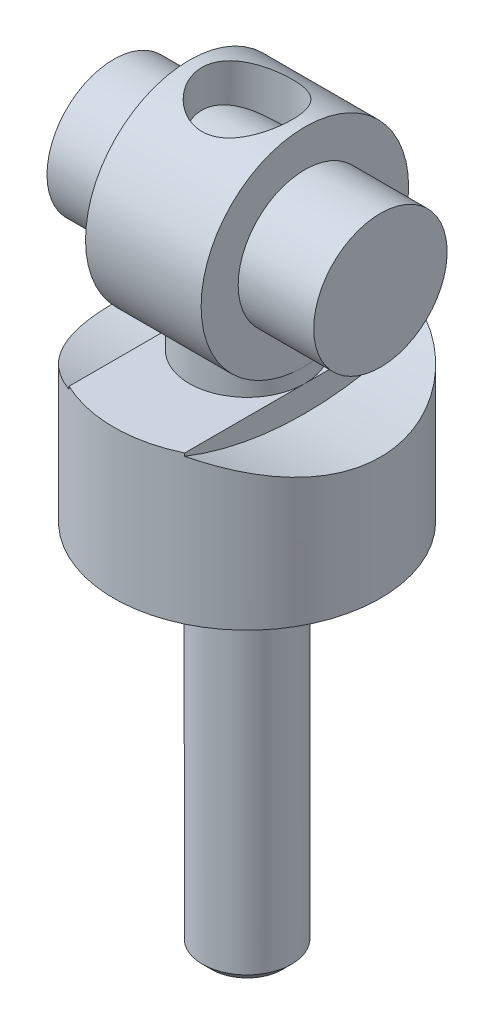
ISO-10303-21;
HEADER;
FILE_DESCRIPTION(('STEP AP214'),'2;1');
FILE_NAME('part.step','',(''),(''),'','','');
FILE_SCHEMA(('AUTOMOTIVE_DESIGN { 1 0 10303 214 1 1 1 1 }'));
ENDSEC;
DATA;
#1=APPLICATION_CONTEXT('core data for automotive mechanical design processes');
#2=APPLICATION_PROTOCOL_DEFINITION('international standard','automotive_design',2000,#1);
#3=PRODUCT_CONTEXT('',#1,'mechanical');
#4=PRODUCT('Part','Part','',(#3));
#5=PRODUCT_RELATED_PRODUCT_CATEGORY('part','',(#4));
#6=PRODUCT_DEFINITION_FORMATION('','',#4);
#7=PRODUCT_DEFINITION_CONTEXT('part definition',#1,'design');
#8=PRODUCT_DEFINITION('design','',#6,#7);
#9=PRODUCT_DEFINITION_SHAPE('','',#8);
#10=(LENGTH_UNIT() NAMED_UNIT(*) SI_UNIT(.MILLI.,.METRE.));
#11=(NAMED_UNIT(*) PLANE_ANGLE_UNIT() SI_UNIT($,.RADIAN.));
#12=(NAMED_UNIT(*) SI_UNIT($,.STERADIAN.) SOLID_ANGLE_UNIT());
#13=UNCERTAINTY_MEASURE_WITH_UNIT(LENGTH_MEASURE(1.E-05),#10,'distance_accuracy_value','');
#14=(GEOMETRIC_REPRESENTATION_CONTEXT(3) GLOBAL_UNCERTAINTY_ASSIGNED_CONTEXT((#13)) GLOBAL_UNIT_ASSIGNED_CONTEXT((#10,
#11,#12)) REPRESENTATION_CONTEXT('',''));
#15=CARTESIAN_POINT('',(0.,0.,0.));
#16=DIRECTION('',(0.,0.,1.));
#17=DIRECTION('',(1.,0.,0.));
#18=AXIS2_PLACEMENT_3D('',#15,#16,#17);
#19=CARTESIAN_POINT('',(9.,0.,0.));
#20=DIRECTION('',(-1.,0.,0.));
#21=DIRECTION('',(0.,0.,1.));
#22=AXIS2_PLACEMENT_3D('',#19,#20,#21);
#23=CYLINDRICAL_SURFACE('',#22,4.5);
#24=CARTESIAN_POINT('',(0.,3.30870065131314,-3.05));
#25=CARTESIAN_POINT('',(-0.0740543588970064,3.30870135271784,-3.04999955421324));
#26=CARTESIAN_POINT('',(-0.148113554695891,3.31120079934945,-3.04729547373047));
#27=CARTESIAN_POINT('',(-0.295501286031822,3.32105327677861,-3.03655247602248));
#28=CARTESIAN_POINT('',(-0.368829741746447,3.32840683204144,-3.02851298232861));
#29=CARTESIAN_POINT('',(-0.58695059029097,3.35728100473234,-2.99658701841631));
#30=CARTESIAN_POINT('',(-0.729787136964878,3.385614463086,-2.96489335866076));
#31=CARTESIAN_POINT('',(-1.00481607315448,3.45535402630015,-2.88328172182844));
#32=CARTESIAN_POINT('',(-1.13710040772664,3.49662694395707,-2.83354864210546));
#33=CARTESIAN_POINT('',(-1.39123632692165,3.58733287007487,-2.71780374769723));
#34=CARTESIAN_POINT('',(-1.51308617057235,3.63676723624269,-2.65178922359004));
#35=CARTESIAN_POINT('',(-1.76446479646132,3.74781440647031,-2.49293203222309));
#36=CARTESIAN_POINT('',(-1.8920441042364,3.81010328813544,-2.39747643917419));
#37=CARTESIAN_POINT('',(-2.13108358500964,3.93428541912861,-2.18776550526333));
#38=CARTESIAN_POINT('',(-2.2425254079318,3.99617814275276,-2.0734890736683));
#39=CARTESIAN_POINT('',(-2.46301512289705,4.1236708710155,-1.80832137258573));
#40=CARTESIAN_POINT('',(-2.56913328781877,4.1884081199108,-1.65450535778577));
#41=CARTESIAN_POINT('',(-2.70696690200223,4.2748001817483,-1.40843177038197));
#42=CARTESIAN_POINT('',(-2.74934801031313,4.30180769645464,-1.32386688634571));
#43=CARTESIAN_POINT('',(-2.82644155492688,4.35148238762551,-1.15011183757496));
#44=CARTESIAN_POINT('',(-2.86115705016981,4.37415129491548,-1.06092353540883));
#45=CARTESIAN_POINT('',(-2.93723315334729,4.42421178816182,-0.834029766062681));
#46=CARTESIAN_POINT('',(-2.97356864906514,4.44850916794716,-0.693888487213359));
#47=CARTESIAN_POINT('',(-3.02602447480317,4.48374237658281,-0.40832853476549));
#48=CARTESIAN_POINT('',(-3.04216027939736,4.49468843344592,-0.262913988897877));
#49=CARTESIAN_POINT('',(-3.0533671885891,4.5022807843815,0.0293654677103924));
#50=CARTESIAN_POINT('',(-3.04840293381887,4.49890307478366,0.176232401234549));
#51=CARTESIAN_POINT('',(-3.01761506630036,4.47809945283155,0.466749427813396));
#52=CARTESIAN_POINT('',(-2.99178532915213,4.46066941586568,0.610398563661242));
#53=CARTESIAN_POINT('',(-2.92131598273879,4.41371882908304,0.888013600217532));
#54=CARTESIAN_POINT('',(-2.87702540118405,4.384422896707,1.02210773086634));
#55=CARTESIAN_POINT('',(-2.77159197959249,4.31597239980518,1.28074304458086));
#56=CARTESIAN_POINT('',(-2.71044594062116,4.27681596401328,1.40528240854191));
#57=CARTESIAN_POINT('',(-2.56551457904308,4.18638203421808,1.65649516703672));
#58=CARTESIAN_POINT('',(-2.47995424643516,4.13423576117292,1.78182668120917));
#59=CARTESIAN_POINT('',(-2.29260341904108,4.02464324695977,2.01721180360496));
#60=CARTESIAN_POINT('',(-2.19079412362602,3.96719089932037,2.12724743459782));
#61=CARTESIAN_POINT('',(-1.95420691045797,3.84118755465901,2.34819750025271));
#62=CARTESIAN_POINT('',(-1.81676442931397,3.7723979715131,2.45613438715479));
#63=CARTESIAN_POINT('',(-1.52359640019,3.64029455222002,2.64798057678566));
#64=CARTESIAN_POINT('',(-1.36788117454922,3.57697765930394,2.7319033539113));
#65=CARTESIAN_POINT('',(-1.07873972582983,3.47813281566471,2.85610629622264));
#66=CARTESIAN_POINT('',(-0.94878391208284,3.43957561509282,2.90201639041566));
#67=CARTESIAN_POINT('',(-0.680934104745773,3.37555318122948,2.97625031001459));
#68=CARTESIAN_POINT('',(-0.543055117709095,3.35006405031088,3.00460625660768));
#69=CARTESIAN_POINT('',(-0.261369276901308,3.31605166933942,3.04212029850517));
#70=CARTESIAN_POINT('',(-0.117523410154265,3.30766771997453,3.05112079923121));
#71=CARTESIAN_POINT('',(0.169846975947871,3.30994043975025,3.04865479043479));
#72=CARTESIAN_POINT('',(0.313371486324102,3.32059763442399,3.03718771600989));
#73=CARTESIAN_POINT('',(0.579273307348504,3.35672225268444,2.99716587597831));
#74=CARTESIAN_POINT('',(0.702224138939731,3.3804057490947,2.97065905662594));
#75=CARTESIAN_POINT('',(0.94170771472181,3.43813602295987,2.9036484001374));
#76=CARTESIAN_POINT('',(1.05823445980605,3.47219229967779,2.86313172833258));
#77=CARTESIAN_POINT('',(1.33453129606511,3.56435394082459,2.74826045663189));
#78=CARTESIAN_POINT('',(1.49008084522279,3.62637602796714,2.6668870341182));
#79=CARTESIAN_POINT('',(1.78349065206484,3.75646016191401,2.48031899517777));
#80=CARTESIAN_POINT('',(1.92131746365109,3.82453323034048,2.37508034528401));
#81=CARTESIAN_POINT('',(2.17938375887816,3.9604362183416,2.14091948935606));
#82=CARTESIAN_POINT('',(2.2993553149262,4.02824992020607,2.01169148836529));
#83=CARTESIAN_POINT('',(2.51660188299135,4.15609145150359,1.73217770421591));
#84=CARTESIAN_POINT('',(2.61391283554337,4.21613154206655,1.58192588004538));
#85=CARTESIAN_POINT('',(2.76724452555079,4.31303677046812,1.29108040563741));
#86=CARTESIAN_POINT('',(2.82752395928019,4.35212259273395,1.15347804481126));
#87=CARTESIAN_POINT('',(2.927713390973,4.41786925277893,0.868215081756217));
#88=CARTESIAN_POINT('',(2.96763645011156,4.44453805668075,0.720560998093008));
#89=CARTESIAN_POINT('',(3.02511265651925,4.48311795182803,0.41827986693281));
#90=CARTESIAN_POINT('',(3.04255880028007,4.49495844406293,0.263623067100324));
#91=CARTESIAN_POINT('',(3.05359112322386,4.50243250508,-0.0469294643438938));
#92=CARTESIAN_POINT('',(3.04718207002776,4.49806931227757,-0.202824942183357));
#93=CARTESIAN_POINT('',(3.01241336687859,4.47459437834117,-0.498210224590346));
#94=CARTESIAN_POINT('',(2.98584821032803,4.45668871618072,-0.638015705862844));
#95=CARTESIAN_POINT('',(2.91428327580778,4.40906289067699,-0.910676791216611));
#96=CARTESIAN_POINT('',(2.86928056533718,4.37934084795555,-1.04353128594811));
#97=CARTESIAN_POINT('',(2.75996758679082,4.30849145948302,-1.30628099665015));
#98=CARTESIAN_POINT('',(2.69478198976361,4.26685537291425,-1.43567105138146));
#99=CARTESIAN_POINT('',(2.54831500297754,4.17589690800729,-1.68200981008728));
#100=CARTESIAN_POINT('',(2.46702497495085,4.12657040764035,-1.79895178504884));
#101=CARTESIAN_POINT('',(2.27621742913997,4.01518689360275,-2.03669083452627));
#102=CARTESIAN_POINT('',(2.16426874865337,3.95235046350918,-2.15517053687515));
#103=CARTESIAN_POINT('',(1.92324507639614,3.82568072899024,-2.37276837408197));
#104=CARTESIAN_POINT('',(1.79415533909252,3.76184660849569,-2.47186965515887));
#105=CARTESIAN_POINT('',(1.52700320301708,3.6422101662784,-2.64476720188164));
#106=CARTESIAN_POINT('',(1.38971103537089,3.58616592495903,-2.71958017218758));
#107=CARTESIAN_POINT('',(1.10202420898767,3.48481309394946,-2.84829695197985));
#108=CARTESIAN_POINT('',(0.951651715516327,3.43948680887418,-2.90223532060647));
#109=CARTESIAN_POINT('',(0.668272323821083,3.37324804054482,-2.97881254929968));
#110=CARTESIAN_POINT('',(0.537042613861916,3.34940288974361,-3.00534763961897));
#111=CARTESIAN_POINT('',(0.337187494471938,3.32517436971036,-3.03205239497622));
#112=CARTESIAN_POINT('',(0.270072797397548,3.3190214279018,-3.03877098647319));
#113=CARTESIAN_POINT('',(0.135306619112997,3.31078493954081,-3.04774423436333));
#114=CARTESIAN_POINT('',(0.0676553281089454,3.30870001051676,-3.05000040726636));
#115=CARTESIAN_POINT('',(0.,3.30870065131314,-3.05));
#116=B_SPLINE_CURVE_WITH_KNOTS('',3,(#24,#25,#26,#27,#28,#29,#30,#31,#32,#33,#34,#35,#36,#37,
#38,#39,#40,#41,#42,#43,#44,#45,#46,#47,#48,#49,#50,#51,#52,#53,#54,#55,#56,#57,#58,#59,#60,#61,
#62,#63,#64,#65,#66,#67,#68,#69,#70,#71,#72,#73,#74,#75,#76,#77,#78,#79,#80,#81,#82,#83,#84,#85,
#86,#87,#88,#89,#90,#91,#92,#93,#94,#95,#96,#97,#98,#99,#100,#101,#102,#103,#104,#105,#106,#107,
#108,#109,#110,#111,#112,#113,#114,#115),.UNSPECIFIED.,.T.,.F.,(4,2,2,2,2,2,2,2,2,2,2,2,2,2,2,2,
2,2,2,2,2,2,2,2,2,2,2,2,2,2,2,2,2,2,2,2,2,2,2,2,2,2,2,2,2,4),(0.,0.22207460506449,
0.444173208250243,0.888639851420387,1.32867397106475,1.76878136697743,2.28012572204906,
2.79204704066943,3.3816546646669,3.67634407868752,3.97091568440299,4.40924515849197,
4.84723863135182,5.28596638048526,5.72482295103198,6.1557338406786,6.58672656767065,
7.06630172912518,7.54643585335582,8.10749203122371,8.66823277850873,9.09600687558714,
9.52299588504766,9.95344853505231,10.3839130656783,10.7663784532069,11.1491951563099,
11.7047959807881,12.2614304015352,12.8257196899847,13.3891078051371,13.8528597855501,
14.3163138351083,14.7819661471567,15.247525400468,15.6758920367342,16.104326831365,
16.5548361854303,17.0055878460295,17.527655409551,18.0501750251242,18.5465955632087,
19.0421906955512,19.4481632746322,19.6511174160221,19.854002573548),.UNSPECIFIED.);
#117=CARTESIAN_POINT('',(0.,3.30870065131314,-3.05));
#118=VERTEX_POINT('',#117);
#119=EDGE_CURVE('E422',#118,#118,#116,.T.);
#120=ORIENTED_EDGE('',*,*,#119,.T.);
#121=EDGE_LOOP('',(#120));
#122=FACE_BOUND('',#121,.T.);
#123=ADVANCED_FACE('F15',(#122),#23,.T.);
#124=CARTESIAN_POINT('',(0.,-18.,0.));
#125=DIRECTION('',(0.,-1.,0.));
#126=DIRECTION('',(0.,0.,-1.));
#127=AXIS2_PLACEMENT_3D('',#124,#125,#126);
#128=CYLINDRICAL_SURFACE('',#127,3.05);
#129=CARTESIAN_POINT('',(-3.05,7.,0.));
#130=CARTESIAN_POINT('',(-3.04999184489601,6.99999348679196,-0.162704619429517));
#131=CARTESIAN_POINT('',(-3.03690325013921,6.99426313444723,-0.325677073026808));
#132=CARTESIAN_POINT('',(-2.9850564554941,6.97191024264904,-0.646949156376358));
#133=CARTESIAN_POINT('',(-2.9462348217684,6.95526078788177,-0.805236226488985));
#134=CARTESIAN_POINT('',(-2.84464299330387,6.91284166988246,-1.11198429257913));
#135=CARTESIAN_POINT('',(-2.78195691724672,6.88710406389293,-1.26047767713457));
#136=CARTESIAN_POINT('',(-2.63478306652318,6.82898400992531,-1.54468326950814));
#137=CARTESIAN_POINT('',(-2.5503007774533,6.79660323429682,-1.68039868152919));
#138=CARTESIAN_POINT('',(-2.35713926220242,6.72644929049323,-1.94273441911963));
#139=CARTESIAN_POINT('',(-2.24747328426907,6.68848909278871,-2.0685776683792));
#140=CARTESIAN_POINT('',(-2.00914953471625,6.61221907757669,-2.3007657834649));
#141=CARTESIAN_POINT('',(-1.88048095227,6.57390907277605,-2.40709947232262));
#142=CARTESIAN_POINT('',(-1.59925069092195,6.49890558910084,-2.60304524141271));
#143=CARTESIAN_POINT('',(-1.44576451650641,6.46241666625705,-2.69141714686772));
#144=CARTESIAN_POINT('',(-1.12429520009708,6.39819011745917,-2.84074274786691));
#145=CARTESIAN_POINT('',(-0.956320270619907,6.37044757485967,-2.90171185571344));
#146=CARTESIAN_POINT('',(-0.619583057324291,6.32889846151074,-2.99121728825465));
#147=CARTESIAN_POINT('',(-0.451302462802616,6.31445045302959,-3.02125585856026));
#148=CARTESIAN_POINT('',(-0.11151746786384,6.29930260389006,-3.05272420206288));
#149=CARTESIAN_POINT('',(0.059984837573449,6.29859411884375,-3.0541719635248));
#150=CARTESIAN_POINT('',(0.385701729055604,6.31046776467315,-3.02954141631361));
#151=CARTESIAN_POINT('',(0.540142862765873,6.32192110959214,-3.0058010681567));
#152=CARTESIAN_POINT('',(0.84257968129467,6.35490505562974,-2.93541752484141));
#153=CARTESIAN_POINT('',(0.990573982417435,6.37643780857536,-2.88876943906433));
#154=CARTESIAN_POINT('',(1.27982174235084,6.4276508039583,-2.77297194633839));
#155=CARTESIAN_POINT('',(1.42085364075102,6.4575007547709,-2.70334757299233));
#156=CARTESIAN_POINT('',(1.6898138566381,6.52195425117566,-2.54391340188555));
#157=CARTESIAN_POINT('',(1.81773672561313,6.55655975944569,-2.45409526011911));
#158=CARTESIAN_POINT('',(2.06940274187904,6.63054514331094,-2.2470063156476));
#159=CARTESIAN_POINT('',(2.19164412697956,6.67006933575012,-2.12795670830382));
#160=CARTESIAN_POINT('',(2.4149580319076,6.74674039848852,-1.87069513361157));
#161=CARTESIAN_POINT('',(2.51602463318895,6.78388660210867,-1.7324778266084));
#162=CARTESIAN_POINT('',(2.69660971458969,6.8528854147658,-1.43587567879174));
#163=CARTESIAN_POINT('',(2.77546244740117,6.88456523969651,-1.27704227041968));
#164=CARTESIAN_POINT('',(2.9047911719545,6.93770958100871,-0.946630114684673));
#165=CARTESIAN_POINT('',(2.9552843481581,6.9591802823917,-0.775059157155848));
#166=CARTESIAN_POINT('',(3.02319063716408,6.98829825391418,-0.436544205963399));
#167=CARTESIAN_POINT('',(3.04261573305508,6.99678458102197,-0.27007608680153));
#168=CARTESIAN_POINT('',(3.05390053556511,7.00169785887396,0.0639465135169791));
#169=CARTESIAN_POINT('',(3.0457691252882,6.99812869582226,0.231500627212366));
#170=CARTESIAN_POINT('',(3.00356158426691,6.97986824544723,0.553152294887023));
#171=CARTESIAN_POINT('',(2.97094639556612,6.96580349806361,0.707481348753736));
#172=CARTESIAN_POINT('',(2.88278479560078,6.92866190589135,1.00827829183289));
#173=CARTESIAN_POINT('',(2.82723555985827,6.90558395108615,1.15474521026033));
#174=CARTESIAN_POINT('',(2.6929926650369,6.85170199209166,1.44084808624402));
#175=CARTESIAN_POINT('',(2.61362998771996,6.82067908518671,1.58012754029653));
#176=CARTESIAN_POINT('',(2.43474310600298,6.75415317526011,1.84389482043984));
#177=CARTESIAN_POINT('',(2.33521020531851,6.71864824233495,1.96837622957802));
#178=CARTESIAN_POINT('',(2.10978279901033,6.64353349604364,2.2092054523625));
#179=CARTESIAN_POINT('',(1.98244058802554,6.60381912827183,2.32416895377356));
#180=CARTESIAN_POINT('',(1.70973248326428,6.52714207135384,2.53153470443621));
#181=CARTESIAN_POINT('',(1.56436100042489,6.49018024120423,2.6239299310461));
#182=CARTESIAN_POINT('',(1.25564984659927,6.42269914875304,2.7850949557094));
#183=CARTESIAN_POINT('',(1.09200468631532,6.39232632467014,2.85334562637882));
#184=CARTESIAN_POINT('',(0.75379241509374,6.34333096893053,2.96069197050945));
#185=CARTESIAN_POINT('',(0.579235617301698,6.32469752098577,2.9998147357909));
#186=CARTESIAN_POINT('',(0.239649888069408,6.30306413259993,3.04498807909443));
#187=CARTESIAN_POINT('',(0.0750213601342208,6.29890231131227,3.05349858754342));
#188=CARTESIAN_POINT('',(-0.253252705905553,6.30354849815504,3.04389705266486));
#189=CARTESIAN_POINT('',(-0.416898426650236,6.31235401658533,3.02579011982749));
#190=CARTESIAN_POINT('',(-0.729129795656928,6.34083967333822,2.96559521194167));
#191=CARTESIAN_POINT('',(-0.878046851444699,6.35988779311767,2.92489692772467));
#192=CARTESIAN_POINT('',(-1.16693860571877,6.40615957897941,2.82210528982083));
#193=CARTESIAN_POINT('',(-1.30691072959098,6.43338558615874,2.76000580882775));
#194=CARTESIAN_POINT('',(-1.58358157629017,6.49506654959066,2.61169289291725));
#195=CARTESIAN_POINT('',(-1.71951916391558,6.52986875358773,2.5242072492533));
#196=CARTESIAN_POINT('',(-1.97555265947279,6.60190781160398,2.32929089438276));
#197=CARTESIAN_POINT('',(-2.09564225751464,6.63914562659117,2.22185227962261));
#198=CARTESIAN_POINT('',(-2.32680566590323,6.71555274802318,1.97959176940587));
#199=CARTESIAN_POINT('',(-2.43631261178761,6.75462711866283,1.84324010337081));
#200=CARTESIAN_POINT('',(-2.631061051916,6.82728275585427,1.55259912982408));
#201=CARTESIAN_POINT('',(-2.71629153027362,6.86086152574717,1.39830172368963));
#202=CARTESIAN_POINT('',(-2.82308954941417,6.90407953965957,1.15770046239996));
#203=CARTESIAN_POINT('',(-2.85504893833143,6.9172350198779,1.07649571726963));
#204=CARTESIAN_POINT('',(-2.91197877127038,6.94092534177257,0.911314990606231));
#205=CARTESIAN_POINT('',(-2.93695256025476,6.95146143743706,0.827340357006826));
#206=CARTESIAN_POINT('',(-2.97957896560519,6.96957822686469,0.657467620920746));
#207=CARTESIAN_POINT('',(-2.99724927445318,6.97716606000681,0.57157470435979));
#208=CARTESIAN_POINT('',(-3.02513606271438,6.98919084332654,0.398412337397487));
#209=CARTESIAN_POINT('',(-3.03535781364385,6.99363002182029,0.311143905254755));
#210=CARTESIAN_POINT('',(-3.04452810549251,6.99761719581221,0.186386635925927));
#211=CARTESIAN_POINT('',(-3.04657900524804,6.99850984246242,0.149145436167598));
#212=CARTESIAN_POINT('',(-3.04931589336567,6.9997019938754,0.0746075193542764));
#213=CARTESIAN_POINT('',(-3.0500018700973,7.00000149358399,0.0373108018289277));
#214=CARTESIAN_POINT('',(-3.05,7.,0.));
#215=B_SPLINE_CURVE_WITH_KNOTS('',3,(#129,#130,#131,#132,#133,#134,#135,#136,#137,#138,#139,
#140,#141,#142,#143,#144,#145,#146,#147,#148,#149,#150,#151,#152,#153,#154,#155,#156,#157,#158,
#159,#160,#161,#162,#163,#164,#165,#166,#167,#168,#169,#170,#171,#172,#173,#174,#175,#176,#177,
#178,#179,#180,#181,#182,#183,#184,#185,#186,#187,#188,#189,#190,#191,#192,#193,#194,#195,#196,
#197,#198,#199,#200,#201,#202,#203,#204,#205,#206,#207,#208,#209,#210,#211,#212,#213,#214),
.UNSPECIFIED.,.T.,.F.,(4,2,2,2,2,2,2,2,2,2,2,2,2,2,2,2,2,2,2,2,2,2,2,2,2,2,2,2,2,2,2,2,2,2,2,2,
2,2,2,2,2,2,4),(0.,0.487968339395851,0.97714405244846,1.46461122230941,1.95195582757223,
2.46330122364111,2.97493865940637,3.51469503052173,4.05414744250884,4.56594870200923,
5.07742794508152,5.54526824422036,6.01320846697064,6.49150094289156,6.96999141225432,
7.49309500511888,8.0163446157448,8.55392067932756,9.09117064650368,9.59196918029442,
10.0926062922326,10.5655333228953,11.0385186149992,11.5262847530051,12.0142616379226,
12.5401685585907,13.0662389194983,13.6030164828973,14.1392941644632,14.6313741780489,
15.1233597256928,15.5879838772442,16.0527411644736,16.5467639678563,17.0409828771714,
17.576072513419,18.1114045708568,18.375869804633,18.6402081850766,18.9039024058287,
19.1674098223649,19.2793079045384,19.3912069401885),.UNSPECIFIED.);
#216=CARTESIAN_POINT('',(-3.05,7.,0.));
#217=VERTEX_POINT('',#216);
#218=EDGE_CURVE('E80',#217,#217,#215,.T.);
#219=ORIENTED_EDGE('',*,*,#218,.F.);
#220=EDGE_LOOP('',(#219));
#221=FACE_BOUND('',#220,.T.);
#222=ORIENTED_EDGE('',*,*,#119,.F.);
#223=EDGE_LOOP('',(#222));
#224=FACE_BOUND('',#223,.T.);
#225=ADVANCED_FACE('F333',(#221,#224),#128,.F.);
#226=CARTESIAN_POINT('',(-9.,0.,0.));
#227=DIRECTION('',(1.,0.,0.));
#228=DIRECTION('',(0.,0.,-1.));
#229=AXIS2_PLACEMENT_3D('',#226,#227,#228);
#230=PLANE('',#229);
#231=CARTESIAN_POINT('',(-9.,0.,0.));
#232=DIRECTION('',(-1.,0.,0.));
#233=DIRECTION('',(0.,0.,1.));
#234=AXIS2_PLACEMENT_3D('',#231,#232,#233);
#235=CIRCLE('',#234,4.5);
#236=CARTESIAN_POINT('',(-9.,0.,4.5));
#237=VERTEX_POINT('',#236);
#238=EDGE_CURVE('E425',#237,#237,#235,.F.);
#239=ORIENTED_EDGE('',*,*,#238,.F.);
#240=EDGE_LOOP('',(#239));
#241=FACE_BOUND('',#240,.T.);
#242=ADVANCED_FACE('F323',(#241),#230,.F.);
#243=CARTESIAN_POINT('',(9.,0.,0.));
#244=DIRECTION('',(1.,0.,0.));
#245=DIRECTION('',(0.,0.,-1.));
#246=AXIS2_PLACEMENT_3D('',#243,#244,#245);
#247=PLANE('',#246);
#248=CARTESIAN_POINT('',(9.,0.,0.));
#249=DIRECTION('',(-1.,0.,0.));
#250=DIRECTION('',(0.,0.,1.));
#251=AXIS2_PLACEMENT_3D('',#248,#249,#250);
#252=CIRCLE('',#251,4.5);
#253=CARTESIAN_POINT('',(9.,0.,4.5));
#254=VERTEX_POINT('',#253);
#255=EDGE_CURVE('E440',#254,#254,#252,.T.);
#256=ORIENTED_EDGE('',*,*,#255,.F.);
#257=EDGE_LOOP('',(#256));
#258=FACE_BOUND('',#257,.T.);
#259=ADVANCED_FACE('F313',(#258),#247,.T.);
#260=CARTESIAN_POINT('',(9.,0.,0.));
#261=DIRECTION('',(-1.,0.,0.));
#262=DIRECTION('',(0.,0.,1.));
#263=AXIS2_PLACEMENT_3D('',#260,#261,#262);
#264=CYLINDRICAL_SURFACE('',#263,4.5);
#265=ORIENTED_EDGE('',*,*,#238,.T.);
#266=EDGE_LOOP('',(#265));
#267=FACE_BOUND('',#266,.T.);
#268=CARTESIAN_POINT('',(-3.9,0.,0.));
#269=DIRECTION('',(-1.,0.,0.));
#270=DIRECTION('',(0.,0.,1.));
#271=AXIS2_PLACEMENT_3D('',#268,#269,#270);
#272=CIRCLE('',#271,4.5);
#273=CARTESIAN_POINT('',(-3.9,0.,4.5));
#274=VERTEX_POINT('',#273);
#275=EDGE_CURVE('E443',#274,#274,#272,.F.);
#276=ORIENTED_EDGE('',*,*,#275,.F.);
#277=EDGE_LOOP('',(#276));
#278=FACE_BOUND('',#277,.T.);
#279=ADVANCED_FACE('F303',(#267,#278),#264,.T.);
#280=CARTESIAN_POINT('',(9.,0.,0.));
#281=DIRECTION('',(-1.,0.,0.));
#282=DIRECTION('',(0.,0.,1.));
#283=AXIS2_PLACEMENT_3D('',#280,#281,#282);
#284=CYLINDRICAL_SURFACE('',#283,4.5);
#285=ORIENTED_EDGE('',*,*,#255,.T.);
#286=EDGE_LOOP('',(#285));
#287=FACE_BOUND('',#286,.T.);
#288=CARTESIAN_POINT('',(3.9,0.,0.));
#289=DIRECTION('',(-1.,0.,0.));
#290=DIRECTION('',(0.,0.,1.));
#291=AXIS2_PLACEMENT_3D('',#288,#289,#290);
#292=CIRCLE('',#291,4.5);
#293=CARTESIAN_POINT('',(3.9,0.,4.5));
#294=VERTEX_POINT('',#293);
#295=EDGE_CURVE('E446',#294,#294,#292,.T.);
#296=ORIENTED_EDGE('',*,*,#295,.F.);
#297=EDGE_LOOP('',(#296));
#298=FACE_BOUND('',#297,.T.);
#299=ADVANCED_FACE('F293',(#287,#298),#284,.T.);
#300=CARTESIAN_POINT('',(0.,-43.,-2.3865));
#301=DIRECTION('',(0.,1.,0.));
#302=DIRECTION('',(0.,0.,1.));
#303=AXIS2_PLACEMENT_3D('',#300,#301,#302);
#304=PLANE('',#303);
#305=CARTESIAN_POINT('',(0.,-43.0000000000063,0.));
#306=DIRECTION('',(0.,1.,0.));
#307=DIRECTION('',(0.,0.,1.));
#308=AXIS2_PLACEMENT_3D('',#305,#306,#307);
#309=CIRCLE('',#308,2.38650000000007);
#310=CARTESIAN_POINT('',(0.,-43.0000000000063,2.38650000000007));
#311=VERTEX_POINT('',#310);
#312=EDGE_CURVE('E68',#311,#311,#309,.T.);
#313=ORIENTED_EDGE('',*,*,#312,.F.);
#314=EDGE_LOOP('',(#313));
#315=FACE_BOUND('',#314,.T.);
#316=ADVANCED_FACE('F284',(#315),#304,.F.);
#317=CARTESIAN_POINT('',(-3.9,7.,0.));
#318=DIRECTION('',(-1.,0.,0.));
#319=DIRECTION('',(0.,0.,1.));
#320=AXIS2_PLACEMENT_3D('',#317,#318,#319);
#321=PLANE('',#320);
#322=CARTESIAN_POINT('',(-3.9,0.,0.));
#323=DIRECTION('',(1.,0.,0.));
#324=DIRECTION('',(0.,0.,-1.));
#325=AXIS2_PLACEMENT_3D('',#322,#323,#324);
#326=CIRCLE('',#325,7.);
#327=CARTESIAN_POINT('',(-3.9,-7.,0.));
#328=VERTEX_POINT('',#327);
#329=EDGE_CURVE('E62',#328,#328,#326,.T.);
#330=ORIENTED_EDGE('',*,*,#329,.F.);
#331=EDGE_LOOP('',(#330));
#332=FACE_BOUND('',#331,.T.);
#333=ORIENTED_EDGE('',*,*,#275,.T.);
#334=EDGE_LOOP('',(#333));
#335=FACE_BOUND('',#334,.T.);
#336=ADVANCED_FACE('F64',(#332,#335),#321,.T.);
#337=CARTESIAN_POINT('',(3.9,4.5,0.));
#338=DIRECTION('',(1.,0.,0.));
#339=DIRECTION('',(0.,0.,-1.));
#340=AXIS2_PLACEMENT_3D('',#337,#338,#339);
#341=PLANE('',#340);
#342=ORIENTED_EDGE('',*,*,#295,.T.);
#343=EDGE_LOOP('',(#342));
#344=FACE_BOUND('',#343,.T.);
#345=CARTESIAN_POINT('',(3.9,0.,0.));
#346=DIRECTION('',(1.,0.,0.));
#347=DIRECTION('',(0.,0.,-1.));
#348=AXIS2_PLACEMENT_3D('',#345,#346,#347);
#349=CIRCLE('',#348,7.);
#350=CARTESIAN_POINT('',(3.9,-7.,0.));
#351=VERTEX_POINT('',#350);
#352=EDGE_CURVE('E57',#351,#351,#349,.F.);
#353=ORIENTED_EDGE('',*,*,#352,.F.);
#354=EDGE_LOOP('',(#353));
#355=FACE_BOUND('',#354,.T.);
#356=ADVANCED_FACE('F266',(#344,#355),#341,.T.);
#357=CARTESIAN_POINT('',(0.,-42.3864999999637,0.));
#358=DIRECTION('',(0.,1.,0.));
#359=DIRECTION('',(0.,0.,1.));
#360=AXIS2_PLACEMENT_3D('',#357,#358,#359);
#361=CONICAL_SURFACE('',#360,3.00000000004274,0.785398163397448);
#362=CARTESIAN_POINT('',(0.,-42.3865,0.));
#363=DIRECTION('',(0.,-1.,0.));
#364=DIRECTION('',(0.,0.,-1.));
#365=AXIS2_PLACEMENT_3D('',#362,#363,#364);
#366=CIRCLE('',#365,3.);
#367=CARTESIAN_POINT('',(0.,-42.3865,-3.));
#368=VERTEX_POINT('',#367);
#369=EDGE_CURVE('E75',#368,#368,#366,.F.);
#370=ORIENTED_EDGE('',*,*,#369,.F.);
#371=EDGE_LOOP('',(#370));
#372=FACE_BOUND('',#371,.T.);
#373=ORIENTED_EDGE('',*,*,#312,.T.);
#374=EDGE_LOOP('',(#373));
#375=FACE_BOUND('',#374,.T.);
#376=ADVANCED_FACE('F116',(#372,#375),#361,.T.);
#377=CARTESIAN_POINT('',(3.9,0.,0.));
#378=DIRECTION('',(1.,0.,0.));
#379=DIRECTION('',(0.,0.,-1.));
#380=AXIS2_PLACEMENT_3D('',#377,#378,#379);
#381=CYLINDRICAL_SURFACE('',#380,7.);
#382=ORIENTED_EDGE('',*,*,#218,.T.);
#383=EDGE_LOOP('',(#382));
#384=FACE_BOUND('',#383,.T.);
#385=CARTESIAN_POINT('',(3.9,-7.,0.));
#386=CARTESIAN_POINT('',(3.90001752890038,-7.00001942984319,0.101466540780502));
#387=CARTESIAN_POINT('',(3.8960407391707,-6.99779436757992,0.202920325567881));
#388=CARTESIAN_POINT('',(3.88023459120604,-6.98900147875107,0.404979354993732));
#389=CARTESIAN_POINT('',(3.86840885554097,-6.98243565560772,0.505584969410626));
#390=CARTESIAN_POINT('',(3.83712075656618,-6.9651514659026,0.704709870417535));
#391=CARTESIAN_POINT('',(3.81769770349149,-6.95445447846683,0.803237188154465));
#392=CARTESIAN_POINT('',(3.77147136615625,-6.92918651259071,0.998015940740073));
#393=CARTESIAN_POINT('',(3.74466753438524,-6.91461524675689,1.09426720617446));
#394=CARTESIAN_POINT('',(3.65370180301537,-6.86563048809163,1.37835919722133));
#395=CARTESIAN_POINT('',(3.57891008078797,-6.82590275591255,1.56200906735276));
#396=CARTESIAN_POINT('',(3.40380598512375,-6.73574624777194,1.91386156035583));
#397=CARTESIAN_POINT('',(3.30346515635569,-6.6853055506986,2.08204667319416));
#398=CARTESIAN_POINT('',(3.07231236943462,-6.57404929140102,2.41124170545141));
#399=CARTESIAN_POINT('',(2.93986961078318,-6.51275678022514,2.57094476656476));
#400=CARTESIAN_POINT('',(2.65186757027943,-6.38792245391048,2.86711328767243));
#401=CARTESIAN_POINT('',(2.49628662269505,-6.32437857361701,3.00355670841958));
#402=CARTESIAN_POINT('',(2.14756121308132,-6.19460980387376,3.26343015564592));
#403=CARTESIAN_POINT('',(1.95220320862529,-6.12877385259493,3.38410813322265));
#404=CARTESIAN_POINT('',(1.54017232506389,-6.01028237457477,3.59036773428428));
#405=CARTESIAN_POINT('',(1.32353114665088,-5.95760764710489,3.67600060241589));
#406=CARTESIAN_POINT('',(0.922015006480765,-5.88301340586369,3.79393631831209));
#407=CARTESIAN_POINT('',(0.74009720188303,-5.85694757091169,3.83368358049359));
#408=CARTESIAN_POINT('',(0.370900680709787,-5.82185014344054,3.88678815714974));
#409=CARTESIAN_POINT('',(0.18362737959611,-5.81280192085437,3.90017123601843));
#410=CARTESIAN_POINT('',(-0.191084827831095,-5.81303377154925,3.89982520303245));
#411=CARTESIAN_POINT('',(-0.378523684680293,-5.82233438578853,3.88606570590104));
#412=CARTESIAN_POINT('',(-0.747934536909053,-5.85794420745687,3.83216543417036));
#413=CARTESIAN_POINT('',(-0.929902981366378,-5.88426422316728,3.79200789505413));
#414=CARTESIAN_POINT('',(-1.28389815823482,-5.9504692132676,3.68723568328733));
#415=CARTESIAN_POINT('',(-1.45592647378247,-5.99035202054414,3.62262491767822));
#416=CARTESIAN_POINT('',(-1.78726824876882,-6.07937506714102,3.47115320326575));
#417=CARTESIAN_POINT('',(-1.94657643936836,-6.12851911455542,3.38428309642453));
#418=CARTESIAN_POINT('',(-2.27378317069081,-6.2396234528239,3.17539062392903));
#419=CARTESIAN_POINT('',(-2.43927737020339,-6.30239479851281,3.05002577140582));
#420=CARTESIAN_POINT('',(-2.74838387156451,-6.42834866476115,2.77476357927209));
#421=CARTESIAN_POINT('',(-2.89197674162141,-6.49153149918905,2.62484469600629));
#422=CARTESIAN_POINT('',(-3.16810265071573,-6.61893812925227,2.28594641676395));
#423=CARTESIAN_POINT('',(-3.29796560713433,-6.68259661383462,2.09453276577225));
#424=CARTESIAN_POINT('',(-3.4666173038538,-6.76794817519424,1.79053831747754));
#425=CARTESIAN_POINT('',(-3.51846944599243,-6.79470487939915,1.68641762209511));
#426=CARTESIAN_POINT('',(-3.6129453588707,-6.84410288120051,1.47315875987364));
#427=CARTESIAN_POINT('',(-3.65557482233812,-6.86674671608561,1.36402373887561));
#428=CARTESIAN_POINT('',(-3.72702625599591,-6.90506459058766,1.15338674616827));
#429=CARTESIAN_POINT('',(-3.75683401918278,-6.92122354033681,1.0523057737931));
#430=CARTESIAN_POINT('',(-3.80826324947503,-6.94927380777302,0.847510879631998));
#431=CARTESIAN_POINT('',(-3.82988621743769,-6.96116590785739,0.743797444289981));
#432=CARTESIAN_POINT('',(-3.86475053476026,-6.98040626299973,0.533921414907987));
#433=CARTESIAN_POINT('',(-3.8779420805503,-6.98772751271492,0.427748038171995));
#434=CARTESIAN_POINT('',(-3.89558100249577,-6.99753834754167,0.214388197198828));
#435=CARTESIAN_POINT('',(-3.90002266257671,-7.00002477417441,0.107201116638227));
#436=CARTESIAN_POINT('',(-3.9,-7.,0.));
#437=B_SPLINE_CURVE_WITH_KNOTS('',3,(#385,#386,#387,#388,#389,#390,#391,#392,#393,#394,#395,
#396,#397,#398,#399,#400,#401,#402,#403,#404,#405,#406,#407,#408,#409,#410,#411,#412,#413,#414,
#415,#416,#417,#418,#419,#420,#421,#422,#423,#424,#425,#426,#427,#428,#429,#430,#431,#432,#433,
#434,#435,#436),.UNSPECIFIED.,.F.,.F.,(4,2,2,2,2,2,2,2,2,2,2,2,2,2,2,2,2,2,2,2,2,2,2,2,2,4),(0.,
0.304276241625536,0.608412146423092,0.9109947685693,1.21359984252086,1.81739142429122,
2.42185844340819,3.06825288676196,3.71525644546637,4.42833551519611,5.14036812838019,
5.70198600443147,6.26305476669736,6.8247519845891,7.3868062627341,7.94877077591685,
8.51096686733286,9.15903068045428,9.80766617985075,10.5232314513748,10.8808672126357,
11.2382815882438,11.5577211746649,11.8771021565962,12.1983526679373,12.5198129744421),.UNSPECIFIED.);
#438=EDGE_CURVE('E74',#351,#328,#437,.T.);
#439=ORIENTED_EDGE('',*,*,#438,.F.);
#440=ORIENTED_EDGE('',*,*,#352,.T.);
#441=CARTESIAN_POINT('',(-3.9,-7.,0.));
#442=CARTESIAN_POINT('',(-3.90001752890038,-7.00001942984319,-0.101466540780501));
#443=CARTESIAN_POINT('',(-3.8960407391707,-6.99779436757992,-0.202920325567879));
#444=CARTESIAN_POINT('',(-3.88023459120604,-6.98900147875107,-0.40497935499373));
#445=CARTESIAN_POINT('',(-3.86840885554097,-6.98243565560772,-0.505584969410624));
#446=CARTESIAN_POINT('',(-3.83712075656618,-6.9651514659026,-0.704709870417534));
#447=CARTESIAN_POINT('',(-3.81769770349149,-6.95445447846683,-0.803237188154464));
#448=CARTESIAN_POINT('',(-3.77147136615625,-6.92918651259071,-0.998015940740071));
#449=CARTESIAN_POINT('',(-3.74466753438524,-6.91461524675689,-1.09426720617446));
#450=CARTESIAN_POINT('',(-3.65370180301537,-6.86563048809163,-1.37835919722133));
#451=CARTESIAN_POINT('',(-3.57891008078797,-6.82590275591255,-1.56200906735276));
#452=CARTESIAN_POINT('',(-3.40380598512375,-6.73574624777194,-1.91386156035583));
#453=CARTESIAN_POINT('',(-3.30346515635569,-6.6853055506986,-2.08204667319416));
#454=CARTESIAN_POINT('',(-3.07231236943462,-6.57404929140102,-2.41124170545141));
#455=CARTESIAN_POINT('',(-2.93986961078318,-6.51275678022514,-2.57094476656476));
#456=CARTESIAN_POINT('',(-2.65186757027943,-6.38792245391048,-2.86711328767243));
#457=CARTESIAN_POINT('',(-2.49628662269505,-6.32437857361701,-3.00355670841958));
#458=CARTESIAN_POINT('',(-2.14756121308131,-6.19460980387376,-3.26343015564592));
#459=CARTESIAN_POINT('',(-1.95220320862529,-6.12877385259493,-3.38410813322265));
#460=CARTESIAN_POINT('',(-1.54017232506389,-6.01028237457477,-3.59036773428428));
#461=CARTESIAN_POINT('',(-1.32353114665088,-5.95760764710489,-3.67600060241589));
#462=CARTESIAN_POINT('',(-0.922015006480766,-5.88301340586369,-3.79393631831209));
#463=CARTESIAN_POINT('',(-0.740097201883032,-5.8569475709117,-3.83368358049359));
#464=CARTESIAN_POINT('',(-0.370900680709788,-5.82185014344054,-3.88678815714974));
#465=CARTESIAN_POINT('',(-0.183627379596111,-5.81280192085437,-3.90017123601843));
#466=CARTESIAN_POINT('',(0.191084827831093,-5.81303377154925,-3.89982520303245));
#467=CARTESIAN_POINT('',(0.378523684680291,-5.82233438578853,-3.88606570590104));
#468=CARTESIAN_POINT('',(0.747934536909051,-5.85794420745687,-3.83216543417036));
#469=CARTESIAN_POINT('',(0.929902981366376,-5.88426422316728,-3.79200789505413));
#470=CARTESIAN_POINT('',(1.28389815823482,-5.9504692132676,-3.68723568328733));
#471=CARTESIAN_POINT('',(1.45592647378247,-5.99035202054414,-3.62262491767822));
#472=CARTESIAN_POINT('',(1.78726824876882,-6.07937506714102,-3.47115320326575));
#473=CARTESIAN_POINT('',(1.94657643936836,-6.12851911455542,-3.38428309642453));
#474=CARTESIAN_POINT('',(2.27378317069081,-6.2396234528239,-3.17539062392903));
#475=CARTESIAN_POINT('',(2.43927737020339,-6.30239479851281,-3.05002577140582));
#476=CARTESIAN_POINT('',(2.74838387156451,-6.42834866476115,-2.77476357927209));
#477=CARTESIAN_POINT('',(2.89197674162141,-6.49153149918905,-2.62484469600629));
#478=CARTESIAN_POINT('',(3.16810265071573,-6.61893812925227,-2.28594641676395));
#479=CARTESIAN_POINT('',(3.29796560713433,-6.68259661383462,-2.09453276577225));
#480=CARTESIAN_POINT('',(3.4666173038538,-6.76794817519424,-1.79053831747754));
#481=CARTESIAN_POINT('',(3.51846944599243,-6.79470487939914,-1.68641762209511));
#482=CARTESIAN_POINT('',(3.61294535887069,-6.84410288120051,-1.47315875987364));
#483=CARTESIAN_POINT('',(3.65557482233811,-6.86674671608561,-1.36402373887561));
#484=CARTESIAN_POINT('',(3.72702625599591,-6.90506459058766,-1.15338674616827));
#485=CARTESIAN_POINT('',(3.75683401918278,-6.92122354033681,-1.0523057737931));
#486=CARTESIAN_POINT('',(3.80826324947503,-6.94927380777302,-0.847510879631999));
#487=CARTESIAN_POINT('',(3.82988621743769,-6.96116590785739,-0.743797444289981));
#488=CARTESIAN_POINT('',(3.86475053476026,-6.98040626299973,-0.533921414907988));
#489=CARTESIAN_POINT('',(3.8779420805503,-6.98772751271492,-0.427748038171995));
#490=CARTESIAN_POINT('',(3.89558100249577,-6.99753834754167,-0.214388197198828));
#491=CARTESIAN_POINT('',(3.90002266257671,-7.00002477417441,-0.107201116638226));
#492=CARTESIAN_POINT('',(3.9,-7.,0.));
#493=B_SPLINE_CURVE_WITH_KNOTS('',3,(#441,#442,#443,#444,#445,#446,#447,#448,#449,#450,#451,
#452,#453,#454,#455,#456,#457,#458,#459,#460,#461,#462,#463,#464,#465,#466,#467,#468,#469,#470,
#471,#472,#473,#474,#475,#476,#477,#478,#479,#480,#481,#482,#483,#484,#485,#486,#487,#488,#489,
#490,#491,#492),.UNSPECIFIED.,.F.,.F.,(4,2,2,2,2,2,2,2,2,2,2,2,2,2,2,2,2,2,2,2,2,2,2,2,2,4),(0.,
0.304276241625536,0.608412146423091,0.9109947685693,1.21359984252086,1.81739142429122,
2.4218584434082,3.06825288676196,3.71525644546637,4.42833551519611,5.14036812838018,
5.70198600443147,6.26305476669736,6.8247519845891,7.38680626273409,7.94877077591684,
8.51096686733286,9.15903068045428,9.80766617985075,10.5232314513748,10.8808672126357,
11.2382815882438,11.5577211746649,11.8771021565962,12.1983526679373,12.5198129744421),.UNSPECIFIED.);
#494=EDGE_CURVE('E71',#328,#351,#493,.T.);
#495=ORIENTED_EDGE('',*,*,#494,.F.);
#496=ORIENTED_EDGE('',*,*,#329,.T.);
#497=EDGE_LOOP('',(#439,#440,#495,#496));
#498=FACE_BOUND('',#497,.T.);
#499=ADVANCED_FACE('F72',(#384,#498),#381,.T.);
#500=CARTESIAN_POINT('',(0.,-43.,0.));
#501=DIRECTION('',(0.,-1.,0.));
#502=DIRECTION('',(0.,0.,-1.));
#503=AXIS2_PLACEMENT_3D('',#500,#501,#502);
#504=CYLINDRICAL_SURFACE('',#503,3.);
#505=CARTESIAN_POINT('',(0.,-18.,0.));
#506=DIRECTION('',(0.,-1.,0.));
#507=DIRECTION('',(0.,0.,-1.));
#508=AXIS2_PLACEMENT_3D('',#505,#506,#507);
#509=CIRCLE('',#508,3.);
#510=CARTESIAN_POINT('',(0.,-18.,-3.));
#511=VERTEX_POINT('',#510);
#512=EDGE_CURVE('E180',#511,#511,#509,.T.);
#513=ORIENTED_EDGE('',*,*,#512,.T.);
#514=EDGE_LOOP('',(#513));
#515=FACE_BOUND('',#514,.T.);
#516=ORIENTED_EDGE('',*,*,#369,.T.);
#517=EDGE_LOOP('',(#516));
#518=FACE_BOUND('',#517,.T.);
#519=ADVANCED_FACE('F106',(#515,#518),#504,.T.);
#520=CARTESIAN_POINT('',(0.,-18.,0.));
#521=DIRECTION('',(0.,-1.,0.));
#522=DIRECTION('',(0.,0.,-1.));
#523=AXIS2_PLACEMENT_3D('',#520,#521,#522);
#524=CYLINDRICAL_SURFACE('',#523,3.9);
#525=ORIENTED_EDGE('',*,*,#494,.T.);
#526=ORIENTED_EDGE('',*,*,#438,.T.);
#527=EDGE_LOOP('',(#525,#526));
#528=FACE_BOUND('',#527,.T.);
#529=CARTESIAN_POINT('',(0.,-8.,0.));
#530=DIRECTION('',(0.,-1.,0.));
#531=DIRECTION('',(0.,0.,-1.));
#532=AXIS2_PLACEMENT_3D('',#529,#530,#531);
#533=CIRCLE('',#532,3.9);
#534=CARTESIAN_POINT('',(3.9,-8.,0.));
#535=VERTEX_POINT('',#534);
#536=CARTESIAN_POINT('',(-3.9,-8.,0.));
#537=VERTEX_POINT('',#536);
#538=EDGE_CURVE('E170',#535,#537,#533,.F.);
#539=ORIENTED_EDGE('',*,*,#538,.T.);
#540=CARTESIAN_POINT('',(0.,-8.,0.));
#541=DIRECTION('',(0.,-1.,0.));
#542=DIRECTION('',(0.,0.,-1.));
#543=AXIS2_PLACEMENT_3D('',#540,#541,#542);
#544=CIRCLE('',#543,3.9);
#545=EDGE_CURVE('E178',#537,#535,#544,.F.);
#546=ORIENTED_EDGE('',*,*,#545,.T.);
#547=EDGE_LOOP('',(#539,#546));
#548=FACE_BOUND('',#547,.T.);
#549=ADVANCED_FACE('F101',(#528,#548),#524,.T.);
#550=CARTESIAN_POINT('',(-3.9,9.1970989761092,0.));
#551=DIRECTION('',(-1.,0.,0.));
#552=DIRECTION('',(0.,0.,1.));
#553=AXIS2_PLACEMENT_3D('',#550,#551,#552);
#554=PLANE('',#553);
#555=DIRECTION('',(0.,0.,-1.));
#556=VECTOR('',#555,1.);
#557=CARTESIAN_POINT('',(-3.9,-8.,-3.9));
#558=LINE('',#557,#556);
#559=CARTESIAN_POINT('',(-3.9,-8.,8.11110350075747));
#560=VERTEX_POINT('',#559);
#561=EDGE_CURVE('E179',#560,#537,#558,.T.);
#562=ORIENTED_EDGE('',*,*,#561,.T.);
#563=DIRECTION('',(0.,0.,-1.));
#564=VECTOR('',#563,1.);
#565=CARTESIAN_POINT('',(-3.9,-8.,-3.9));
#566=LINE('',#565,#564);
#567=CARTESIAN_POINT('',(-3.9,-8.,-8.11110350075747));
#568=VERTEX_POINT('',#567);
#569=EDGE_CURVE('E169',#537,#568,#566,.T.);
#570=ORIENTED_EDGE('',*,*,#569,.T.);
#571=DIRECTION('',(0.,1.,0.));
#572=VECTOR('',#571,1.);
#573=CARTESIAN_POINT('',(-3.9,9.1970989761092,-8.11110350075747));
#574=LINE('',#573,#572);
#575=CARTESIAN_POINT('',(-3.9,-8.19616347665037,-8.11110350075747));
#576=VERTEX_POINT('',#575);
#577=EDGE_CURVE('E77',#568,#576,#574,.F.);
#578=ORIENTED_EDGE('',*,*,#577,.T.);
#579=CARTESIAN_POINT('',(-3.9,12.1970989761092,0.));
#580=DIRECTION('',(-1.,0.,0.));
#581=DIRECTION('',(0.,0.,1.));
#582=AXIS2_PLACEMENT_3D('',#579,#580,#581);
#583=CIRCLE('',#582,21.9470989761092);
#584=CARTESIAN_POINT('',(-3.9,-8.19616347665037,8.11110350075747));
#585=VERTEX_POINT('',#584);
#586=EDGE_CURVE('E174',#576,#585,#583,.T.);
#587=ORIENTED_EDGE('',*,*,#586,.T.);
#588=DIRECTION('',(0.,1.,0.));
#589=VECTOR('',#588,1.);
#590=CARTESIAN_POINT('',(-3.9,9.1970989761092,8.11110350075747));
#591=LINE('',#590,#589);
#592=EDGE_CURVE('E189',#585,#560,#591,.T.);
#593=ORIENTED_EDGE('',*,*,#592,.T.);
#594=EDGE_LOOP('',(#562,#570,#578,#587,#593));
#595=FACE_BOUND('',#594,.T.);
#596=ADVANCED_FACE('F105',(#595),#554,.T.);
#597=CARTESIAN_POINT('',(3.9,-9.75,0.));
#598=DIRECTION('',(1.,0.,0.));
#599=DIRECTION('',(0.,0.,-1.));
#600=AXIS2_PLACEMENT_3D('',#597,#598,#599);
#601=PLANE('',#600);
#602=DIRECTION('',(0.,0.,-1.));
#603=VECTOR('',#602,1.);
#604=CARTESIAN_POINT('',(3.9,-8.,-3.9));
#605=LINE('',#604,#603);
#606=CARTESIAN_POINT('',(3.9,-8.,-8.11110350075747));
#607=VERTEX_POINT('',#606);
#608=EDGE_CURVE('E173',#607,#535,#605,.F.);
#609=ORIENTED_EDGE('',*,*,#608,.T.);
#610=DIRECTION('',(0.,0.,-1.));
#611=VECTOR('',#610,1.);
#612=CARTESIAN_POINT('',(3.9,-8.,-3.9));
#613=LINE('',#612,#611);
#614=CARTESIAN_POINT('',(3.9,-8.,8.11110350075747));
#615=VERTEX_POINT('',#614);
#616=EDGE_CURVE('E177',#535,#615,#613,.F.);
#617=ORIENTED_EDGE('',*,*,#616,.T.);
#618=DIRECTION('',(0.,1.,0.));
#619=VECTOR('',#618,1.);
#620=CARTESIAN_POINT('',(3.9,-9.75,8.11110350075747));
#621=LINE('',#620,#619);
#622=CARTESIAN_POINT('',(3.9,-8.19616347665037,8.11110350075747));
#623=VERTEX_POINT('',#622);
#624=EDGE_CURVE('E183',#615,#623,#621,.F.);
#625=ORIENTED_EDGE('',*,*,#624,.T.);
#626=CARTESIAN_POINT('',(3.9,12.1970989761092,0.));
#627=DIRECTION('',(-1.,0.,0.));
#628=DIRECTION('',(0.,0.,1.));
#629=AXIS2_PLACEMENT_3D('',#626,#627,#628);
#630=CIRCLE('',#629,21.9470989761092);
#631=CARTESIAN_POINT('',(3.9,-8.19616347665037,-8.11110350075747));
#632=VERTEX_POINT('',#631);
#633=EDGE_CURVE('E165',#623,#632,#630,.F.);
#634=ORIENTED_EDGE('',*,*,#633,.T.);
#635=DIRECTION('',(0.,1.,0.));
#636=VECTOR('',#635,1.);
#637=CARTESIAN_POINT('',(3.9,-9.75,-8.11110350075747));
#638=LINE('',#637,#636);
#639=EDGE_CURVE('E33',#632,#607,#638,.T.);
#640=ORIENTED_EDGE('',*,*,#639,.T.);
#641=EDGE_LOOP('',(#609,#617,#625,#634,#640));
#642=FACE_BOUND('',#641,.T.);
#643=ADVANCED_FACE('F215',(#642),#601,.T.);
#644=CARTESIAN_POINT('',(0.,-18.,-9.));
#645=DIRECTION('',(0.,1.,0.));
#646=DIRECTION('',(0.,0.,1.));
#647=AXIS2_PLACEMENT_3D('',#644,#645,#646);
#648=PLANE('',#647);
#649=CARTESIAN_POINT('',(0.,-18.,0.));
#650=DIRECTION('',(0.,-1.,0.));
#651=DIRECTION('',(0.,0.,-1.));
#652=AXIS2_PLACEMENT_3D('',#649,#650,#651);
#653=CIRCLE('',#652,9.);
#654=CARTESIAN_POINT('',(0.,-18.,-9.));
#655=VERTEX_POINT('',#654);
#656=EDGE_CURVE('E161',#655,#655,#653,.F.);
#657=ORIENTED_EDGE('',*,*,#656,.F.);
#658=EDGE_LOOP('',(#657));
#659=FACE_BOUND('',#658,.T.);
#660=ORIENTED_EDGE('',*,*,#512,.F.);
#661=EDGE_LOOP('',(#660));
#662=FACE_BOUND('',#661,.T.);
#663=ADVANCED_FACE('F209',(#659,#662),#648,.F.);
#664=CARTESIAN_POINT('',(0.,-8.,-3.9));
#665=DIRECTION('',(0.,-1.,0.));
#666=DIRECTION('',(0.,0.,-1.));
#667=AXIS2_PLACEMENT_3D('',#664,#665,#666);
#668=PLANE('',#667);
#669=ORIENTED_EDGE('',*,*,#545,.F.);
#670=ORIENTED_EDGE('',*,*,#561,.F.);
#671=CARTESIAN_POINT('',(0.,-8.,0.));
#672=DIRECTION('',(0.,-1.,0.));
#673=DIRECTION('',(0.,0.,-1.));
#674=AXIS2_PLACEMENT_3D('',#671,#672,#673);
#675=CIRCLE('',#674,9.);
#676=EDGE_CURVE('E158',#615,#560,#675,.T.);
#677=ORIENTED_EDGE('',*,*,#676,.F.);
#678=ORIENTED_EDGE('',*,*,#616,.F.);
#679=EDGE_LOOP('',(#669,#670,#677,#678));
#680=FACE_BOUND('',#679,.T.);
#681=ADVANCED_FACE('F202',(#680),#668,.F.);
#682=CARTESIAN_POINT('',(-18.,12.1970989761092,0.));
#683=DIRECTION('',(-1.,0.,0.));
#684=DIRECTION('',(0.,0.,1.));
#685=AXIS2_PLACEMENT_3D('',#682,#683,#684);
#686=CYLINDRICAL_SURFACE('',#685,21.9470989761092);
#687=CARTESIAN_POINT('',(-3.9,-8.19616347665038,8.11110350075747));
#688=CARTESIAN_POINT('',(-4.13277236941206,-8.24066617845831,7.99919620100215));
#689=CARTESIAN_POINT('',(-4.3602324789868,-8.2880183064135,7.87747859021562));
#690=CARTESIAN_POINT('',(-4.80317958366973,-8.38685646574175,7.6154836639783));
#691=CARTESIAN_POINT('',(-5.01866967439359,-8.43834141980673,7.47521117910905));
#692=CARTESIAN_POINT('',(-5.43653140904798,-8.54392547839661,7.17705043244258));
#693=CARTESIAN_POINT('',(-5.63889793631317,-8.59802558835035,7.0191553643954));
#694=CARTESIAN_POINT('',(-6.0292748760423,-8.7072593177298,6.68681936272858));
#695=CARTESIAN_POINT('',(-6.21728440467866,-8.76239300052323,6.51237741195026));
#696=CARTESIAN_POINT('',(-6.5777674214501,-8.87213690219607,6.14805894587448));
#697=CARTESIAN_POINT('',(-6.75024490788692,-8.92674725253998,5.95818642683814));
#698=CARTESIAN_POINT('',(-7.07861590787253,-9.0339601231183,5.56407934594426));
#699=CARTESIAN_POINT('',(-7.23450989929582,-9.08656270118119,5.35984519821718));
#700=CARTESIAN_POINT('',(-7.52861864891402,-9.18832157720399,4.93821459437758));
#701=CARTESIAN_POINT('',(-7.66683413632,-9.23747801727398,4.72081868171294));
#702=CARTESIAN_POINT('',(-7.92444032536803,-9.33096423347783,4.27430003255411));
#703=CARTESIAN_POINT('',(-8.04384074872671,-9.37529649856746,4.04518343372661));
#704=CARTESIAN_POINT('',(-8.262012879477,-9.45759746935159,3.57840767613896));
#705=CARTESIAN_POINT('',(-8.36093507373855,-9.49561216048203,3.34082706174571));
#706=CARTESIAN_POINT('',(-8.53832930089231,-9.56459990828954,2.85714547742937));
#707=CARTESIAN_POINT('',(-8.61680133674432,-9.59557296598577,2.61104450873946));
#708=CARTESIAN_POINT('',(-8.75243239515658,-9.64955646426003,2.11227207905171));
#709=CARTESIAN_POINT('',(-8.80959910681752,-9.6725697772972,1.85960302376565));
#710=CARTESIAN_POINT('',(-8.90199698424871,-9.70995268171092,1.34965918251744));
#711=CARTESIAN_POINT('',(-8.9372296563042,-9.72432286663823,1.09238471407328));
#712=CARTESIAN_POINT('',(-8.9836696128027,-9.74329903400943,0.59334708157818));
#713=CARTESIAN_POINT('',(-8.99637316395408,-9.74851287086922,0.35174508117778));
#714=CARTESIAN_POINT('',(-9.00228216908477,-9.75093572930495,-0.131730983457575));
#715=CARTESIAN_POINT('',(-8.99548859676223,-9.74814515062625,-0.373605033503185));
#716=CARTESIAN_POINT('',(-8.96248096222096,-9.73463587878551,-0.855756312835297));
#717=CARTESIAN_POINT('',(-8.93627013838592,-9.72391850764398,-1.0960338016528));
#718=CARTESIAN_POINT('',(-8.86471088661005,-9.69484440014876,-1.57324972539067));
#719=CARTESIAN_POINT('',(-8.81936246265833,-9.67648766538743,-1.81018816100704));
#720=CARTESIAN_POINT('',(-8.71152126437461,-9.63323292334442,-2.27247770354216));
#721=CARTESIAN_POINT('',(-8.64954264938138,-9.60853191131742,-2.49796761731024));
#722=CARTESIAN_POINT('',(-8.50847843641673,-9.55296208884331,-2.94283309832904));
#723=CARTESIAN_POINT('',(-8.42938677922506,-9.52209109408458,-3.1622064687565));
#724=CARTESIAN_POINT('',(-8.2547815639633,-9.45492360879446,-3.59342279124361));
#725=CARTESIAN_POINT('',(-8.15926967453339,-9.41862766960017,-3.80526650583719));
#726=CARTESIAN_POINT('',(-7.95251226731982,-9.34143408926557,-4.22034765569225));
#727=CARTESIAN_POINT('',(-7.84126087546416,-9.30053473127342,-4.42358184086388));
#728=CARTESIAN_POINT('',(-7.59796111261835,-9.21296079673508,-4.83009601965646));
#729=CARTESIAN_POINT('',(-7.46515794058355,-9.16610092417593,-5.03288450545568));
#730=CARTESIAN_POINT('',(-7.18395897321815,-9.06947053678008,-5.42672225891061));
#731=CARTESIAN_POINT('',(-7.03555687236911,-9.01969884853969,-5.61776672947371));
#732=CARTESIAN_POINT('',(-6.72417537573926,-8.91848850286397,-5.98696370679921));
#733=CARTESIAN_POINT('',(-6.56120283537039,-8.86705063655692,-6.16512220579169));
#734=CARTESIAN_POINT('',(-6.22155476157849,-8.76373809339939,-6.50772704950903));
#735=CARTESIAN_POINT('',(-6.04487600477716,-8.71186331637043,-6.67217014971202));
#736=CARTESIAN_POINT('',(-5.56534093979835,-8.57710129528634,-7.08373664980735));
#737=CARTESIAN_POINT('',(-5.25200501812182,-8.4948678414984,-7.3191252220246));
#738=CARTESIAN_POINT('',(-4.76042018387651,-8.37743403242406,-7.6404710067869));
#739=CARTESIAN_POINT('',(-4.5929894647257,-8.33928096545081,-7.74228338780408));
#740=CARTESIAN_POINT('',(-4.25141275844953,-8.26559502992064,-7.93497878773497));
#741=CARTESIAN_POINT('',(-4.07726715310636,-8.23006201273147,-8.02586242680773));
#742=CARTESIAN_POINT('',(-3.9,-8.19616347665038,-8.11110350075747));
#743=B_SPLINE_CURVE_WITH_KNOTS('',3,(#687,#688,#689,#690,#691,#692,#693,#694,#695,#696,#697,
#698,#699,#700,#701,#702,#703,#704,#705,#706,#707,#708,#709,#710,#711,#712,#713,#714,#715,#716,
#717,#718,#719,#720,#721,#722,#723,#724,#725,#726,#727,#728,#729,#730,#731,#732,#733,#734,#735,
#736,#737,#738,#739,#740,#741,#742),.UNSPECIFIED.,.F.,.F.,(4,2,2,2,2,2,2,2,2,2,2,2,2,2,2,2,2,2,
2,2,2,2,2,2,2,2,2,4),(0.,0.785928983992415,1.57165376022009,2.35768305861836,3.14376070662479,
3.92963541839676,4.71548747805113,5.50130711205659,6.28671937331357,7.06613723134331,
7.84555497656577,8.62469115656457,9.40377382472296,10.1288452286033,10.853880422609,
11.5787947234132,12.3037088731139,13.0083783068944,13.7132976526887,14.4181454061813,
15.1232569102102,15.8631236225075,16.6032905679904,17.34311107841,18.083106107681,
19.2805805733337,19.8791316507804,20.477648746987),.UNSPECIFIED.);
#744=EDGE_CURVE('E141',#585,#576,#743,.T.);
#745=ORIENTED_EDGE('',*,*,#744,.F.);
#746=ORIENTED_EDGE('',*,*,#586,.F.);
#747=EDGE_LOOP('',(#745,#746));
#748=FACE_BOUND('',#747,.T.);
#749=ADVANCED_FACE('F200',(#748),#686,.F.);
#750=CARTESIAN_POINT('',(0.,-8.,-3.9));
#751=DIRECTION('',(0.,-1.,0.));
#752=DIRECTION('',(0.,0.,-1.));
#753=AXIS2_PLACEMENT_3D('',#750,#751,#752);
#754=PLANE('',#753);
#755=ORIENTED_EDGE('',*,*,#538,.F.);
#756=ORIENTED_EDGE('',*,*,#608,.F.);
#757=CARTESIAN_POINT('',(0.,-8.,0.));
#758=DIRECTION('',(0.,-1.,0.));
#759=DIRECTION('',(0.,0.,-1.));
#760=AXIS2_PLACEMENT_3D('',#757,#758,#759);
#761=CIRCLE('',#760,9.);
#762=EDGE_CURVE('E25',#568,#607,#761,.T.);
#763=ORIENTED_EDGE('',*,*,#762,.F.);
#764=ORIENTED_EDGE('',*,*,#569,.F.);
#765=EDGE_LOOP('',(#755,#756,#763,#764));
#766=FACE_BOUND('',#765,.T.);
#767=ADVANCED_FACE('F129',(#766),#754,.F.);
#768=CARTESIAN_POINT('',(-18.,12.1970989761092,0.));
#769=DIRECTION('',(-1.,0.,0.));
#770=DIRECTION('',(0.,0.,1.));
#771=AXIS2_PLACEMENT_3D('',#768,#769,#770);
#772=CYLINDRICAL_SURFACE('',#771,21.9470989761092);
#773=CARTESIAN_POINT('',(3.9,-8.19616347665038,-8.11110350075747));
#774=CARTESIAN_POINT('',(4.13277236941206,-8.24066617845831,-7.99919620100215));
#775=CARTESIAN_POINT('',(4.3602324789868,-8.2880183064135,-7.87747859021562));
#776=CARTESIAN_POINT('',(4.80317958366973,-8.38685646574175,-7.6154836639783));
#777=CARTESIAN_POINT('',(5.01866967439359,-8.43834141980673,-7.47521117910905));
#778=CARTESIAN_POINT('',(5.43653140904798,-8.54392547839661,-7.17705043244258));
#779=CARTESIAN_POINT('',(5.63889793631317,-8.59802558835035,-7.0191553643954));
#780=CARTESIAN_POINT('',(6.0292748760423,-8.7072593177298,-6.68681936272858));
#781=CARTESIAN_POINT('',(6.21728440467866,-8.76239300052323,-6.51237741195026));
#782=CARTESIAN_POINT('',(6.5777674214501,-8.87213690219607,-6.14805894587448));
#783=CARTESIAN_POINT('',(6.75024490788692,-8.92674725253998,-5.95818642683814));
#784=CARTESIAN_POINT('',(7.07861590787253,-9.0339601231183,-5.56407934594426));
#785=CARTESIAN_POINT('',(7.23450989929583,-9.08656270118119,-5.35984519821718));
#786=CARTESIAN_POINT('',(7.52861864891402,-9.18832157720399,-4.93821459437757));
#787=CARTESIAN_POINT('',(7.66683413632,-9.23747801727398,-4.72081868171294));
#788=CARTESIAN_POINT('',(7.92444032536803,-9.33096423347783,-4.2743000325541));
#789=CARTESIAN_POINT('',(8.04384074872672,-9.37529649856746,-4.04518343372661));
#790=CARTESIAN_POINT('',(8.26201287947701,-9.45759746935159,-3.57840767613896));
#791=CARTESIAN_POINT('',(8.36093507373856,-9.49561216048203,-3.3408270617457));
#792=CARTESIAN_POINT('',(8.53832930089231,-9.56459990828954,-2.85714547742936));
#793=CARTESIAN_POINT('',(8.61680133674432,-9.59557296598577,-2.61104450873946));
#794=CARTESIAN_POINT('',(8.75243239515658,-9.64955646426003,-2.11227207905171));
#795=CARTESIAN_POINT('',(8.80959910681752,-9.6725697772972,-1.85960302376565));
#796=CARTESIAN_POINT('',(8.90199698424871,-9.70995268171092,-1.34965918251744));
#797=CARTESIAN_POINT('',(8.9372296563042,-9.72432286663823,-1.09238471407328));
#798=CARTESIAN_POINT('',(8.9836696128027,-9.74329903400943,-0.593347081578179));
#799=CARTESIAN_POINT('',(8.99637316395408,-9.74851287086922,-0.351745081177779));
#800=CARTESIAN_POINT('',(9.00228216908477,-9.75093572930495,0.131730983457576));
#801=CARTESIAN_POINT('',(8.99548859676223,-9.74814515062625,0.373605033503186));
#802=CARTESIAN_POINT('',(8.96248096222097,-9.73463587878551,0.855756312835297));
#803=CARTESIAN_POINT('',(8.93627013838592,-9.72391850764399,1.0960338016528));
#804=CARTESIAN_POINT('',(8.86471088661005,-9.69484440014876,1.57324972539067));
#805=CARTESIAN_POINT('',(8.81936246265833,-9.67648766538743,1.81018816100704));
#806=CARTESIAN_POINT('',(8.71152126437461,-9.63323292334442,2.27247770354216));
#807=CARTESIAN_POINT('',(8.64954264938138,-9.60853191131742,2.49796761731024));
#808=CARTESIAN_POINT('',(8.50847843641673,-9.55296208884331,2.94283309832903));
#809=CARTESIAN_POINT('',(8.42938677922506,-9.52209109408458,3.1622064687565));
#810=CARTESIAN_POINT('',(8.2547815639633,-9.45492360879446,3.59342279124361));
#811=CARTESIAN_POINT('',(8.15926967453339,-9.41862766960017,3.80526650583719));
#812=CARTESIAN_POINT('',(7.95251226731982,-9.34143408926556,4.22034765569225));
#813=CARTESIAN_POINT('',(7.84126087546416,-9.30053473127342,4.42358184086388));
#814=CARTESIAN_POINT('',(7.59796111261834,-9.21296079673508,4.83009601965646));
#815=CARTESIAN_POINT('',(7.46515794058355,-9.16610092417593,5.03288450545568));
#816=CARTESIAN_POINT('',(7.18395897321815,-9.06947053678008,5.42672225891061));
#817=CARTESIAN_POINT('',(7.03555687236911,-9.01969884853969,5.61776672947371));
#818=CARTESIAN_POINT('',(6.72417537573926,-8.91848850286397,5.98696370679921));
#819=CARTESIAN_POINT('',(6.56120283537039,-8.86705063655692,6.16512220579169));
#820=CARTESIAN_POINT('',(6.22155476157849,-8.76373809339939,6.50772704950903));
#821=CARTESIAN_POINT('',(6.04487600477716,-8.71186331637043,6.67217014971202));
#822=CARTESIAN_POINT('',(5.56534093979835,-8.57710129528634,7.08373664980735));
#823=CARTESIAN_POINT('',(5.25200501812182,-8.4948678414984,7.3191252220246));
#824=CARTESIAN_POINT('',(4.76042018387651,-8.37743403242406,7.6404710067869));
#825=CARTESIAN_POINT('',(4.5929894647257,-8.33928096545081,7.74228338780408));
#826=CARTESIAN_POINT('',(4.25141275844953,-8.26559502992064,7.93497878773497));
#827=CARTESIAN_POINT('',(4.07726715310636,-8.23006201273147,8.02586242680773));
#828=CARTESIAN_POINT('',(3.9,-8.19616347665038,8.11110350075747));
#829=B_SPLINE_CURVE_WITH_KNOTS('',3,(#773,#774,#775,#776,#777,#778,#779,#780,#781,#782,#783,
#784,#785,#786,#787,#788,#789,#790,#791,#792,#793,#794,#795,#796,#797,#798,#799,#800,#801,#802,
#803,#804,#805,#806,#807,#808,#809,#810,#811,#812,#813,#814,#815,#816,#817,#818,#819,#820,#821,
#822,#823,#824,#825,#826,#827,#828),.UNSPECIFIED.,.F.,.F.,(4,2,2,2,2,2,2,2,2,2,2,2,2,2,2,2,2,2,
2,2,2,2,2,2,2,2,2,4),(0.,0.785928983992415,1.57165376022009,2.35768305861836,3.14376070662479,
3.92963541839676,4.71548747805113,5.5013071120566,6.28671937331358,7.06613723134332,
7.84555497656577,8.62469115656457,9.40377382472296,10.1288452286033,10.853880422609,
11.5787947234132,12.3037088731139,13.0083783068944,13.7132976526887,14.4181454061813,
15.1232569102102,15.8631236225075,16.6032905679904,17.34311107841,18.083106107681,
19.2805805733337,19.8791316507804,20.477648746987),.UNSPECIFIED.);
#830=EDGE_CURVE('E9',#632,#623,#829,.T.);
#831=ORIENTED_EDGE('',*,*,#830,.F.);
#832=ORIENTED_EDGE('',*,*,#633,.F.);
#833=EDGE_LOOP('',(#831,#832));
#834=FACE_BOUND('',#833,.T.);
#835=ADVANCED_FACE('F122',(#834),#772,.F.);
#836=CARTESIAN_POINT('',(0.,-18.,0.));
#837=DIRECTION('',(0.,-1.,0.));
#838=DIRECTION('',(0.,0.,-1.));
#839=AXIS2_PLACEMENT_3D('',#836,#837,#838);
#840=CYLINDRICAL_SURFACE('',#839,9.);
#841=ORIENTED_EDGE('',*,*,#639,.F.);
#842=ORIENTED_EDGE('',*,*,#830,.T.);
#843=ORIENTED_EDGE('',*,*,#624,.F.);
#844=ORIENTED_EDGE('',*,*,#676,.T.);
#845=ORIENTED_EDGE('',*,*,#592,.F.);
#846=ORIENTED_EDGE('',*,*,#744,.T.);
#847=ORIENTED_EDGE('',*,*,#577,.F.);
#848=ORIENTED_EDGE('',*,*,#762,.T.);
#849=EDGE_LOOP('',(#841,#842,#843,#844,#845,#846,#847,#848));
#850=FACE_BOUND('',#849,.T.);
#851=ORIENTED_EDGE('',*,*,#656,.T.);
#852=EDGE_LOOP('',(#851));
#853=FACE_BOUND('',#852,.T.);
#854=ADVANCED_FACE('F120',(#850,#853),#840,.T.);
#855=CLOSED_SHELL('',(#123,#225,#242,#259,#279,#299,#316,#336,#356,#376,#499,#519,#549,#596,
#643,#663,#681,#749,#767,#835,#854));
#856=CARTESIAN_POINT('',(0.,-14.,0.));
#857=DIRECTION('',(0.,-1.,0.));
#858=DIRECTION('',(0.,0.,-1.));
#859=AXIS2_PLACEMENT_3D('',#856,#857,#858);
#860=PLANE('',#859);
#861=CARTESIAN_POINT('',(0.,-14.,0.));
#862=DIRECTION('',(0.,-1.,0.));
#863=DIRECTION('',(0.,0.,-1.));
#864=AXIS2_PLACEMENT_3D('',#861,#862,#863);
#865=CIRCLE('',#864,3.05);
#866=CARTESIAN_POINT('',(0.,-14.,-3.05));
#867=VERTEX_POINT('',#866);
#868=EDGE_CURVE('E19',#867,#867,#865,.F.);
#869=ORIENTED_EDGE('',*,*,#868,.T.);
#870=EDGE_LOOP('',(#869));
#871=FACE_BOUND('',#870,.T.);
#872=ADVANCED_FACE('F135',(#871),#860,.F.);
#873=CARTESIAN_POINT('',(9.,0.,0.));
#874=DIRECTION('',(-1.,0.,0.));
#875=DIRECTION('',(0.,0.,1.));
#876=AXIS2_PLACEMENT_3D('',#873,#874,#875);
#877=CYLINDRICAL_SURFACE('',#876,4.5);
#878=CARTESIAN_POINT('',(0.,-3.30870065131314,-3.05));
#879=CARTESIAN_POINT('',(0.0740543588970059,-3.30870135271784,-3.04999955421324));
#880=CARTESIAN_POINT('',(0.14811355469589,-3.31120079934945,-3.04729547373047));
#881=CARTESIAN_POINT('',(0.295501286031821,-3.32105327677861,-3.03655247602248));
#882=CARTESIAN_POINT('',(0.368829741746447,-3.32840683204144,-3.02851298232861));
#883=CARTESIAN_POINT('',(0.586950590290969,-3.35728100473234,-2.99658701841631));
#884=CARTESIAN_POINT('',(0.729787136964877,-3.385614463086,-2.96489335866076));
#885=CARTESIAN_POINT('',(1.00481607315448,-3.45535402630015,-2.88328172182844));
#886=CARTESIAN_POINT('',(1.13710040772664,-3.49662694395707,-2.83354864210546));
#887=CARTESIAN_POINT('',(1.39123632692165,-3.58733287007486,-2.71780374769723));
#888=CARTESIAN_POINT('',(1.51308617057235,-3.63676723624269,-2.65178922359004));
#889=CARTESIAN_POINT('',(1.76446479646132,-3.74781440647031,-2.49293203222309));
#890=CARTESIAN_POINT('',(1.8920441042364,-3.81010328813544,-2.39747643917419));
#891=CARTESIAN_POINT('',(2.13108358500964,-3.93428541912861,-2.18776550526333));
#892=CARTESIAN_POINT('',(2.2425254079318,-3.99617814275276,-2.0734890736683));
#893=CARTESIAN_POINT('',(2.46301512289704,-4.1236708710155,-1.80832137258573));
#894=CARTESIAN_POINT('',(2.56913328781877,-4.1884081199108,-1.65450535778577));
#895=CARTESIAN_POINT('',(2.70696690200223,-4.2748001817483,-1.40843177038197));
#896=CARTESIAN_POINT('',(2.74934801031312,-4.30180769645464,-1.32386688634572));
#897=CARTESIAN_POINT('',(2.82644155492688,-4.35148238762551,-1.15011183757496));
#898=CARTESIAN_POINT('',(2.86115705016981,-4.37415129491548,-1.06092353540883));
#899=CARTESIAN_POINT('',(2.93723315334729,-4.42421178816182,-0.834029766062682));
#900=CARTESIAN_POINT('',(2.97356864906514,-4.44850916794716,-0.69388848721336));
#901=CARTESIAN_POINT('',(3.02602447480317,-4.48374237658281,-0.40832853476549));
#902=CARTESIAN_POINT('',(3.04216027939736,-4.49468843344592,-0.262913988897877));
#903=CARTESIAN_POINT('',(3.0533671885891,-4.5022807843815,0.029365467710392));
#904=CARTESIAN_POINT('',(3.04840293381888,-4.49890307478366,0.176232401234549));
#905=CARTESIAN_POINT('',(3.01761506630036,-4.47809945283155,0.466749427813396));
#906=CARTESIAN_POINT('',(2.99178532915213,-4.46066941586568,0.610398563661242));
#907=CARTESIAN_POINT('',(2.92131598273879,-4.41371882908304,0.888013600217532));
#908=CARTESIAN_POINT('',(2.87702540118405,-4.384422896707,1.02210773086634));
#909=CARTESIAN_POINT('',(2.77159197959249,-4.31597239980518,1.28074304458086));
#910=CARTESIAN_POINT('',(2.71044594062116,-4.27681596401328,1.40528240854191));
#911=CARTESIAN_POINT('',(2.56551457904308,-4.18638203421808,1.65649516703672));
#912=CARTESIAN_POINT('',(2.47995424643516,-4.13423576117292,1.78182668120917));
#913=CARTESIAN_POINT('',(2.29260341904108,-4.02464324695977,2.01721180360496));
#914=CARTESIAN_POINT('',(2.19079412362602,-3.96719089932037,2.12724743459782));
#915=CARTESIAN_POINT('',(1.95420691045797,-3.84118755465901,2.34819750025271));
#916=CARTESIAN_POINT('',(1.81676442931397,-3.7723979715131,2.45613438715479));
#917=CARTESIAN_POINT('',(1.52359640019,-3.64029455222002,2.64798057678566));
#918=CARTESIAN_POINT('',(1.36788117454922,-3.57697765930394,2.7319033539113));
#919=CARTESIAN_POINT('',(1.07873972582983,-3.47813281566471,2.85610629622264));
#920=CARTESIAN_POINT('',(0.948783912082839,-3.43957561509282,2.90201639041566));
#921=CARTESIAN_POINT('',(0.680934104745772,-3.37555318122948,2.97625031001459));
#922=CARTESIAN_POINT('',(0.543055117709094,-3.35006405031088,3.00460625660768));
#923=CARTESIAN_POINT('',(0.261369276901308,-3.31605166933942,3.04212029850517));
#924=CARTESIAN_POINT('',(0.117523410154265,-3.30766771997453,3.05112079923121));
#925=CARTESIAN_POINT('',(-0.169846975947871,-3.30994043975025,3.04865479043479));
#926=CARTESIAN_POINT('',(-0.313371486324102,-3.32059763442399,3.03718771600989));
#927=CARTESIAN_POINT('',(-0.579273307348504,-3.35672225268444,2.99716587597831));
#928=CARTESIAN_POINT('',(-0.70222413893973,-3.3804057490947,2.97065905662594));
#929=CARTESIAN_POINT('',(-0.941707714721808,-3.43813602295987,2.9036484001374));
#930=CARTESIAN_POINT('',(-1.05823445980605,-3.47219229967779,2.86313172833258));
#931=CARTESIAN_POINT('',(-1.33453129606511,-3.56435394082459,2.74826045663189));
#932=CARTESIAN_POINT('',(-1.49008084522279,-3.62637602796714,2.6668870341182));
#933=CARTESIAN_POINT('',(-1.78349065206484,-3.75646016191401,2.48031899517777));
#934=CARTESIAN_POINT('',(-1.92131746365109,-3.82453323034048,2.37508034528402));
#935=CARTESIAN_POINT('',(-2.17938375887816,-3.9604362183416,2.14091948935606));
#936=CARTESIAN_POINT('',(-2.2993553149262,-4.02824992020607,2.01169148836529));
#937=CARTESIAN_POINT('',(-2.51660188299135,-4.15609145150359,1.73217770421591));
#938=CARTESIAN_POINT('',(-2.61391283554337,-4.21613154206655,1.58192588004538));
#939=CARTESIAN_POINT('',(-2.76724452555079,-4.31303677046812,1.29108040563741));
#940=CARTESIAN_POINT('',(-2.82752395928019,-4.35212259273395,1.15347804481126));
#941=CARTESIAN_POINT('',(-2.927713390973,-4.41786925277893,0.868215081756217));
#942=CARTESIAN_POINT('',(-2.96763645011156,-4.44453805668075,0.720560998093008));
#943=CARTESIAN_POINT('',(-3.02511265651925,-4.48311795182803,0.41827986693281));
#944=CARTESIAN_POINT('',(-3.04255880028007,-4.49495844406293,0.263623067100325));
#945=CARTESIAN_POINT('',(-3.05359112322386,-4.50243250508,-0.0469294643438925));
#946=CARTESIAN_POINT('',(-3.04718207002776,-4.49806931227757,-0.202824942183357));
#947=CARTESIAN_POINT('',(-3.01241336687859,-4.47459437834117,-0.498210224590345));
#948=CARTESIAN_POINT('',(-2.98584821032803,-4.45668871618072,-0.638015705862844));
#949=CARTESIAN_POINT('',(-2.91428327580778,-4.40906289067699,-0.91067679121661));
#950=CARTESIAN_POINT('',(-2.86928056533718,-4.37934084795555,-1.04353128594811));
#951=CARTESIAN_POINT('',(-2.75996758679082,-4.30849145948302,-1.30628099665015));
#952=CARTESIAN_POINT('',(-2.69478198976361,-4.26685537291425,-1.43567105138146));
#953=CARTESIAN_POINT('',(-2.54831500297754,-4.17589690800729,-1.68200981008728));
#954=CARTESIAN_POINT('',(-2.46702497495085,-4.12657040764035,-1.79895178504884));
#955=CARTESIAN_POINT('',(-2.27621742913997,-4.01518689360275,-2.03669083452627));
#956=CARTESIAN_POINT('',(-2.16426874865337,-3.95235046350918,-2.15517053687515));
#957=CARTESIAN_POINT('',(-1.92324507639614,-3.82568072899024,-2.37276837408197));
#958=CARTESIAN_POINT('',(-1.79415533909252,-3.76184660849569,-2.47186965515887));
#959=CARTESIAN_POINT('',(-1.52700320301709,-3.6422101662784,-2.64476720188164));
#960=CARTESIAN_POINT('',(-1.38971103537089,-3.58616592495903,-2.71958017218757));
#961=CARTESIAN_POINT('',(-1.10202420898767,-3.48481309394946,-2.84829695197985));
#962=CARTESIAN_POINT('',(-0.951651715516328,-3.43948680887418,-2.90223532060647));
#963=CARTESIAN_POINT('',(-0.668272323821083,-3.37324804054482,-2.97881254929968));
#964=CARTESIAN_POINT('',(-0.537042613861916,-3.34940288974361,-3.00534763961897));
#965=CARTESIAN_POINT('',(-0.33718749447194,-3.32517436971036,-3.03205239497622));
#966=CARTESIAN_POINT('',(-0.270072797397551,-3.31902142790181,-3.03877098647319));
#967=CARTESIAN_POINT('',(-0.135306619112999,-3.31078493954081,-3.04774423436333));
#968=CARTESIAN_POINT('',(-0.0676553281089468,-3.30870001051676,-3.05000040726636));
#969=CARTESIAN_POINT('',(0.,-3.30870065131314,-3.05));
#970=B_SPLINE_CURVE_WITH_KNOTS('',3,(#878,#879,#880,#881,#882,#883,#884,#885,#886,#887,#888,
#889,#890,#891,#892,#893,#894,#895,#896,#897,#898,#899,#900,#901,#902,#903,#904,#905,#906,#907,
#908,#909,#910,#911,#912,#913,#914,#915,#916,#917,#918,#919,#920,#921,#922,#923,#924,#925,#926,
#927,#928,#929,#930,#931,#932,#933,#934,#935,#936,#937,#938,#939,#940,#941,#942,#943,#944,#945,
#946,#947,#948,#949,#950,#951,#952,#953,#954,#955,#956,#957,#958,#959,#960,#961,#962,#963,#964,
#965,#966,#967,#968,#969),.UNSPECIFIED.,.T.,.F.,(4,2,2,2,2,2,2,2,2,2,2,2,2,2,2,2,2,2,2,2,2,2,2,
2,2,2,2,2,2,2,2,2,2,2,2,2,2,2,2,2,2,2,2,2,2,4),(0.,0.22207460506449,0.444173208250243,
0.888639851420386,1.32867397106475,1.76878136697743,2.28012572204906,2.79204704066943,
3.3816546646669,3.67634407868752,3.97091568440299,4.40924515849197,4.84723863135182,
5.28596638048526,5.72482295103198,6.1557338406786,6.58672656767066,7.06630172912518,
7.54643585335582,8.10749203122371,8.66823277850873,9.09600687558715,9.52299588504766,
9.95344853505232,10.3839130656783,10.7663784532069,11.1491951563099,11.7047959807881,
12.2614304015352,12.8257196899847,13.3891078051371,13.8528597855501,14.3163138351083,
14.7819661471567,15.247525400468,15.6758920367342,16.104326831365,16.5548361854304,
17.0055878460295,17.527655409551,18.0501750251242,18.5465955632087,19.0421906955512,
19.4481632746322,19.6511174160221,19.8540025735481),.UNSPECIFIED.);
#971=CARTESIAN_POINT('',(0.,-3.30870065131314,-3.05));
#972=VERTEX_POINT('',#971);
#973=EDGE_CURVE('E420',#972,#972,#970,.T.);
#974=ORIENTED_EDGE('',*,*,#973,.T.);
#975=EDGE_LOOP('',(#974));
#976=FACE_BOUND('',#975,.T.);
#977=ADVANCED_FACE('F362',(#976),#877,.T.);
#978=CARTESIAN_POINT('',(0.,-18.,0.));
#979=DIRECTION('',(0.,-1.,0.));
#980=DIRECTION('',(0.,0.,-1.));
#981=AXIS2_PLACEMENT_3D('',#978,#979,#980);
#982=CYLINDRICAL_SURFACE('',#981,3.05);
#983=ORIENTED_EDGE('',*,*,#973,.F.);
#984=EDGE_LOOP('',(#983));
#985=FACE_BOUND('',#984,.T.);
#986=ORIENTED_EDGE('',*,*,#868,.F.);
#987=EDGE_LOOP('',(#986));
#988=FACE_BOUND('',#987,.T.);
#989=ADVANCED_FACE('F357',(#985,#988),#982,.F.);
#990=CLOSED_SHELL('',(#872,#977,#989));
#991=ORIENTED_CLOSED_SHELL('',*,#990,.T.);
#992=BREP_WITH_VOIDS('B1',#855,(#991));
#993=ADVANCED_BREP_SHAPE_REPRESENTATION('',(#18,#992),#14);
#994=SHAPE_DEFINITION_REPRESENTATION(#9,#993);
ENDSEC;
END-ISO-10303-21;
